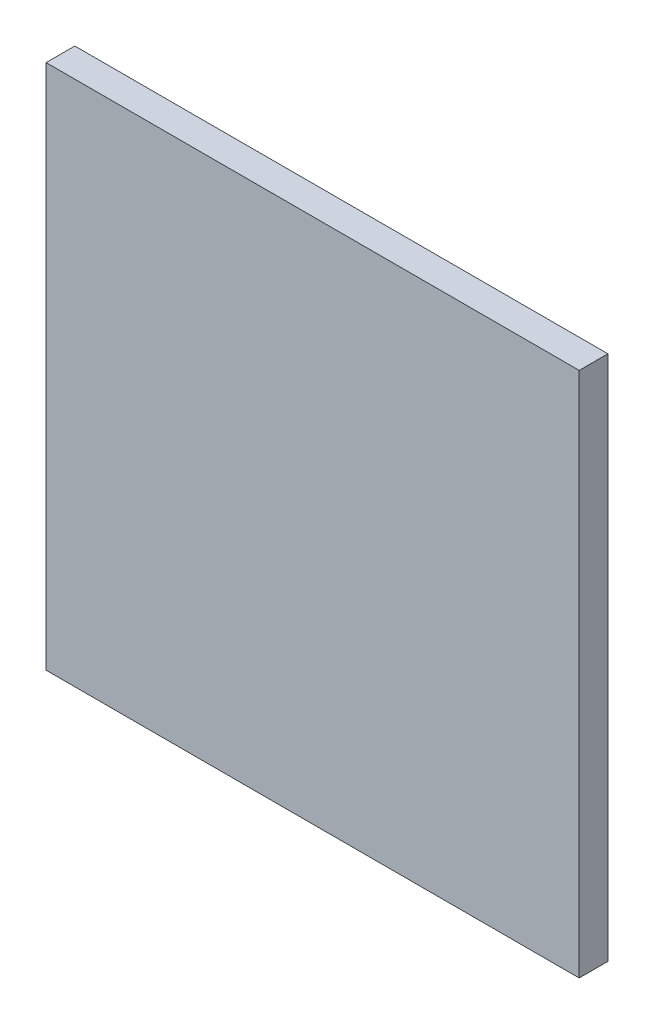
from build123d import *

# Parameters (mm, degrees)
ESQUISSE1_W      = 19.3
ESQUISSE1_H      = 19.05
EXTRUSION1_DEPTH = 1.04


with BuildPart() as part:
    # Esquisse1 → Extrusion1 (new body)
    with BuildSketch(Plane.XY):
        with Locations((9.65, 9.525)):
            Rectangle(ESQUISSE1_W, ESQUISSE1_H)
    extrude(amount=EXTRUSION1_DEPTH)


solid = part.part
